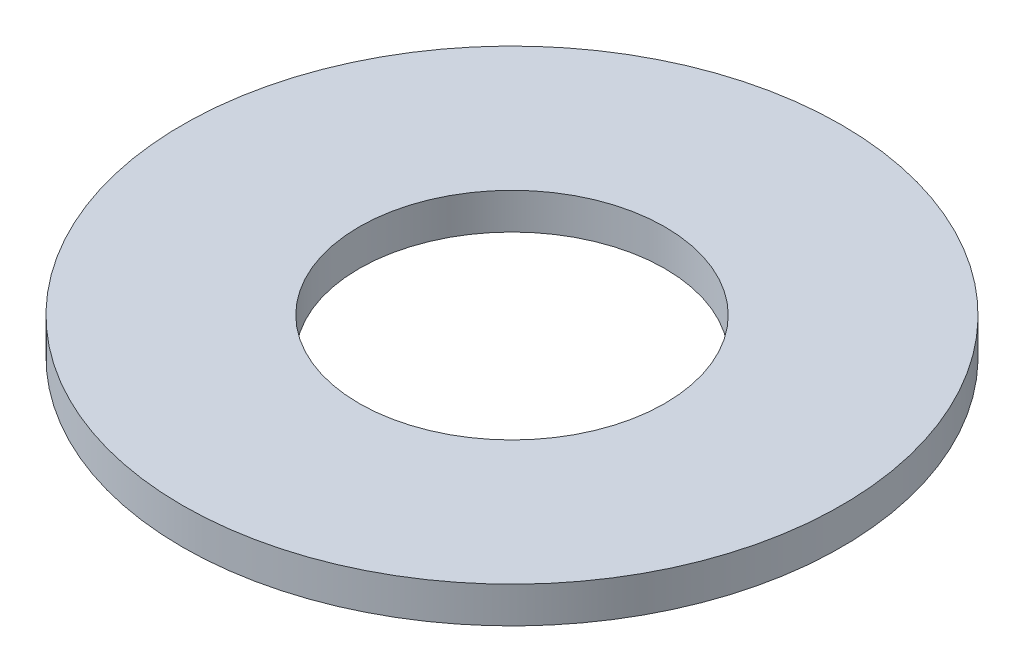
from build123d import *

# Parameters (mm, degrees)
SKETCH1_R           = 5.55625
BOSS_EXTRUDE1_DEPTH = 0.6096
SKETCH5_R           = 2.5781
CUT_EXTRUDE1_DEPTH  = 8.88133493


with BuildPart() as part:
    # Sketch1 → Boss-Extrude1 (new body)
    with BuildSketch(Plane(origin=(0, 0, 0), x_dir=(1, 0, 0), z_dir=(0, 1, 0))):
        with Locations(Location((0, 0, 0), (0, 0, 270))):
            Circle(SKETCH1_R)
    extrude(amount=BOSS_EXTRUDE1_DEPTH)

    # Sketch5 → Cut-Extrude1 (cut, through all)
    with BuildSketch(Plane(origin=(0, 0.6096, 0), x_dir=(-1, 0, 0), z_dir=(0, 1, 0))):
        with Locations(Location((0, 0, 0), (0, 0, 90))):
            Circle(SKETCH5_R)
    extrude(amount=-CUT_EXTRUDE1_DEPTH, mode=Mode.SUBTRACT)


solid = part.part
